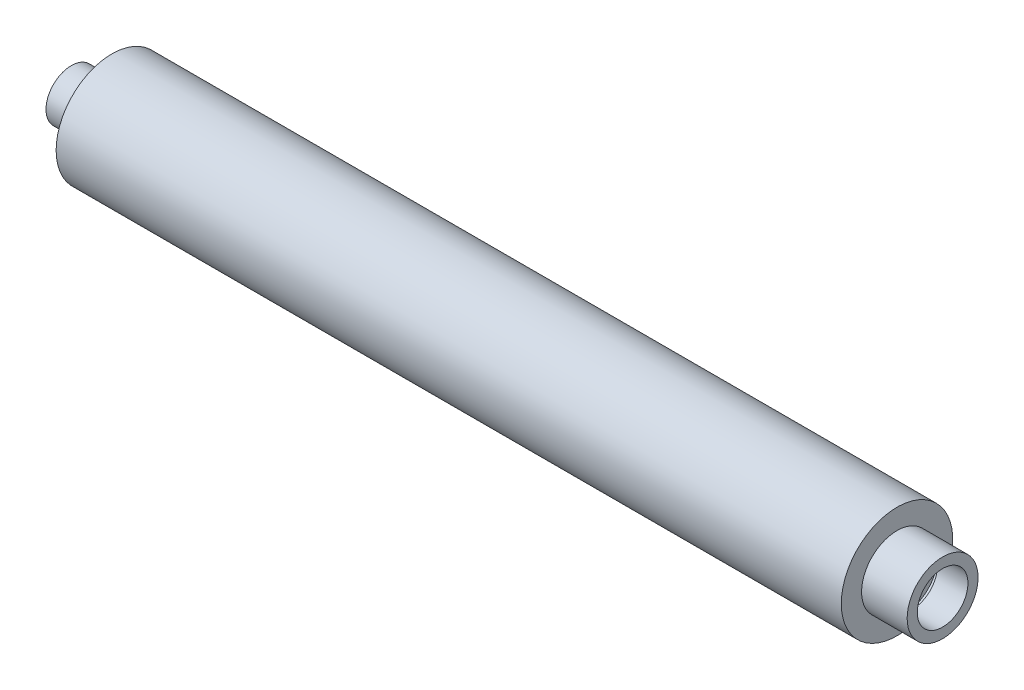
ISO-10303-21;
HEADER;
FILE_DESCRIPTION(('STEP AP214'),'2;1');
FILE_NAME('part.step','',(''),(''),'','','');
FILE_SCHEMA(('AUTOMOTIVE_DESIGN { 1 0 10303 214 1 1 1 1 }'));
ENDSEC;
DATA;
#1=APPLICATION_CONTEXT('core data for automotive mechanical design processes');
#2=APPLICATION_PROTOCOL_DEFINITION('international standard','automotive_design',2000,#1);
#3=PRODUCT_CONTEXT('',#1,'mechanical');
#4=PRODUCT('Part','Part','',(#3));
#5=PRODUCT_RELATED_PRODUCT_CATEGORY('part','',(#4));
#6=PRODUCT_DEFINITION_FORMATION('','',#4);
#7=PRODUCT_DEFINITION_CONTEXT('part definition',#1,'design');
#8=PRODUCT_DEFINITION('design','',#6,#7);
#9=PRODUCT_DEFINITION_SHAPE('','',#8);
#10=(LENGTH_UNIT() NAMED_UNIT(*) SI_UNIT(.MILLI.,.METRE.));
#11=(NAMED_UNIT(*) PLANE_ANGLE_UNIT() SI_UNIT($,.RADIAN.));
#12=(NAMED_UNIT(*) SI_UNIT($,.STERADIAN.) SOLID_ANGLE_UNIT());
#13=UNCERTAINTY_MEASURE_WITH_UNIT(LENGTH_MEASURE(1.E-05),#10,'distance_accuracy_value','');
#14=(GEOMETRIC_REPRESENTATION_CONTEXT(3) GLOBAL_UNCERTAINTY_ASSIGNED_CONTEXT((#13)) GLOBAL_UNIT_ASSIGNED_CONTEXT((#10,
#11,#12)) REPRESENTATION_CONTEXT('',''));
#15=CARTESIAN_POINT('',(0.,0.,0.));
#16=DIRECTION('',(0.,0.,1.));
#17=DIRECTION('',(1.,0.,0.));
#18=AXIS2_PLACEMENT_3D('',#15,#16,#17);
#19=CARTESIAN_POINT('',(-38.,0.,0.));
#20=DIRECTION('',(1.,0.,0.));
#21=DIRECTION('',(0.,0.,-1.));
#22=AXIS2_PLACEMENT_3D('',#19,#20,#21);
#23=PLANE('',#22);
#24=CARTESIAN_POINT('',(-38.,0.,0.));
#25=DIRECTION('',(-1.,0.,0.));
#26=DIRECTION('',(0.,0.,1.));
#27=AXIS2_PLACEMENT_3D('',#24,#25,#26);
#28=CIRCLE('',#27,5.);
#29=CARTESIAN_POINT('',(-38.,0.,5.));
#30=VERTEX_POINT('',#29);
#31=EDGE_CURVE('E10',#30,#30,#28,.T.);
#32=ORIENTED_EDGE('',*,*,#31,.T.);
#33=EDGE_LOOP('',(#32));
#34=FACE_BOUND('',#33,.T.);
#35=ADVANCED_FACE('F28',(#34),#23,.F.);
#36=CARTESIAN_POINT('',(-50.,0.,0.));
#37=DIRECTION('',(-1.,0.,0.));
#38=DIRECTION('',(0.,0.,1.));
#39=AXIS2_PLACEMENT_3D('',#36,#37,#38);
#40=CYLINDRICAL_SURFACE('',#39,5.);
#41=ORIENTED_EDGE('',*,*,#31,.F.);
#42=EDGE_LOOP('',(#41));
#43=FACE_BOUND('',#42,.T.);
#44=CARTESIAN_POINT('',(-30.,0.,0.));
#45=DIRECTION('',(-1.,0.,0.));
#46=DIRECTION('',(0.,0.,1.));
#47=AXIS2_PLACEMENT_3D('',#44,#45,#46);
#48=CIRCLE('',#47,5.);
#49=CARTESIAN_POINT('',(-30.,0.,5.));
#50=VERTEX_POINT('',#49);
#51=EDGE_CURVE('E34',#50,#50,#48,.T.);
#52=ORIENTED_EDGE('',*,*,#51,.T.);
#53=EDGE_LOOP('',(#52));
#54=FACE_BOUND('',#53,.T.);
#55=ADVANCED_FACE('F90',(#43,#54),#40,.T.);
#56=CARTESIAN_POINT('',(-30.,5.,0.));
#57=DIRECTION('',(1.,0.,0.));
#58=DIRECTION('',(0.,0.,-1.));
#59=AXIS2_PLACEMENT_3D('',#56,#57,#58);
#60=PLANE('',#59);
#61=ORIENTED_EDGE('',*,*,#51,.F.);
#62=EDGE_LOOP('',(#61));
#63=FACE_BOUND('',#62,.T.);
#64=CARTESIAN_POINT('',(-30.,0.,0.));
#65=DIRECTION('',(-1.,0.,0.));
#66=DIRECTION('',(0.,0.,1.));
#67=AXIS2_PLACEMENT_3D('',#64,#65,#66);
#68=CIRCLE('',#67,11.);
#69=CARTESIAN_POINT('',(-30.,0.,11.));
#70=VERTEX_POINT('',#69);
#71=EDGE_CURVE('E38',#70,#70,#68,.T.);
#72=ORIENTED_EDGE('',*,*,#71,.T.);
#73=EDGE_LOOP('',(#72));
#74=FACE_BOUND('',#73,.T.);
#75=ADVANCED_FACE('F94',(#63,#74),#60,.F.);
#76=CARTESIAN_POINT('',(-50.,0.,0.));
#77=DIRECTION('',(-1.,0.,0.));
#78=DIRECTION('',(0.,0.,1.));
#79=AXIS2_PLACEMENT_3D('',#76,#77,#78);
#80=CYLINDRICAL_SURFACE('',#79,11.);
#81=ORIENTED_EDGE('',*,*,#71,.F.);
#82=EDGE_LOOP('',(#81));
#83=FACE_BOUND('',#82,.T.);
#84=CARTESIAN_POINT('',(125.,0.,0.));
#85=DIRECTION('',(-1.,0.,0.));
#86=DIRECTION('',(0.,0.,1.));
#87=AXIS2_PLACEMENT_3D('',#84,#85,#86);
#88=CIRCLE('',#87,11.);
#89=CARTESIAN_POINT('',(125.,0.,11.));
#90=VERTEX_POINT('',#89);
#91=EDGE_CURVE('E42',#90,#90,#88,.T.);
#92=ORIENTED_EDGE('',*,*,#91,.T.);
#93=EDGE_LOOP('',(#92));
#94=FACE_BOUND('',#93,.T.);
#95=ADVANCED_FACE('F99',(#83,#94),#80,.T.);
#96=CARTESIAN_POINT('',(125.,11.,0.));
#97=DIRECTION('',(-1.,0.,0.));
#98=DIRECTION('',(0.,0.,1.));
#99=AXIS2_PLACEMENT_3D('',#96,#97,#98);
#100=PLANE('',#99);
#101=ORIENTED_EDGE('',*,*,#91,.F.);
#102=EDGE_LOOP('',(#101));
#103=FACE_BOUND('',#102,.T.);
#104=CARTESIAN_POINT('',(125.,0.,0.));
#105=DIRECTION('',(-1.,0.,0.));
#106=DIRECTION('',(0.,0.,1.));
#107=AXIS2_PLACEMENT_3D('',#104,#105,#106);
#108=CIRCLE('',#107,7.00000000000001);
#109=CARTESIAN_POINT('',(125.,0.,7.00000000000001));
#110=VERTEX_POINT('',#109);
#111=EDGE_CURVE('E47',#110,#110,#108,.T.);
#112=ORIENTED_EDGE('',*,*,#111,.T.);
#113=EDGE_LOOP('',(#112));
#114=FACE_BOUND('',#113,.T.);
#115=ADVANCED_FACE('F105',(#103,#114),#100,.F.);
#116=CARTESIAN_POINT('',(-50.,0.,0.));
#117=DIRECTION('',(-1.,0.,0.));
#118=DIRECTION('',(0.,0.,1.));
#119=AXIS2_PLACEMENT_3D('',#116,#117,#118);
#120=CYLINDRICAL_SURFACE('',#119,7.00000000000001);
#121=ORIENTED_EDGE('',*,*,#111,.F.);
#122=EDGE_LOOP('',(#121));
#123=FACE_BOUND('',#122,.T.);
#124=CARTESIAN_POINT('',(134.,0.,0.));
#125=DIRECTION('',(-1.,0.,0.));
#126=DIRECTION('',(0.,0.,1.));
#127=AXIS2_PLACEMENT_3D('',#124,#125,#126);
#128=CIRCLE('',#127,7.00000000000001);
#129=CARTESIAN_POINT('',(134.,0.,7.00000000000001));
#130=VERTEX_POINT('',#129);
#131=EDGE_CURVE('E50',#130,#130,#128,.T.);
#132=ORIENTED_EDGE('',*,*,#131,.T.);
#133=EDGE_LOOP('',(#132));
#134=FACE_BOUND('',#133,.T.);
#135=ADVANCED_FACE('F109',(#123,#134),#120,.T.);
#136=CARTESIAN_POINT('',(134.,7.00000000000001,0.));
#137=DIRECTION('',(-1.,0.,0.));
#138=DIRECTION('',(0.,0.,1.));
#139=AXIS2_PLACEMENT_3D('',#136,#137,#138);
#140=PLANE('',#139);
#141=ORIENTED_EDGE('',*,*,#131,.F.);
#142=EDGE_LOOP('',(#141));
#143=FACE_BOUND('',#142,.T.);
#144=CARTESIAN_POINT('',(134.,0.,0.));
#145=DIRECTION('',(-1.,0.,0.));
#146=DIRECTION('',(0.,0.,1.));
#147=AXIS2_PLACEMENT_3D('',#144,#145,#146);
#148=CIRCLE('',#147,5.);
#149=CARTESIAN_POINT('',(134.,0.,5.));
#150=VERTEX_POINT('',#149);
#151=EDGE_CURVE('E53',#150,#150,#148,.T.);
#152=ORIENTED_EDGE('',*,*,#151,.T.);
#153=EDGE_LOOP('',(#152));
#154=FACE_BOUND('',#153,.T.);
#155=ADVANCED_FACE('F113',(#143,#154),#140,.F.);
#156=CARTESIAN_POINT('',(-50.,0.,0.));
#157=DIRECTION('',(-1.,0.,0.));
#158=DIRECTION('',(0.,0.,1.));
#159=AXIS2_PLACEMENT_3D('',#156,#157,#158);
#160=CYLINDRICAL_SURFACE('',#159,5.);
#161=ORIENTED_EDGE('',*,*,#151,.F.);
#162=EDGE_LOOP('',(#161));
#163=FACE_BOUND('',#162,.T.);
#164=CARTESIAN_POINT('',(128.,0.,0.));
#165=DIRECTION('',(-1.,0.,0.));
#166=DIRECTION('',(0.,0.,1.));
#167=AXIS2_PLACEMENT_3D('',#164,#165,#166);
#168=CIRCLE('',#167,5.);
#169=CARTESIAN_POINT('',(128.,0.,5.));
#170=VERTEX_POINT('',#169);
#171=EDGE_CURVE('E56',#170,#170,#168,.T.);
#172=ORIENTED_EDGE('',*,*,#171,.T.);
#173=EDGE_LOOP('',(#172));
#174=FACE_BOUND('',#173,.T.);
#175=ADVANCED_FACE('F117',(#163,#174),#160,.F.);
#176=CARTESIAN_POINT('',(128.,5.,0.));
#177=DIRECTION('',(1.,0.,0.));
#178=DIRECTION('',(0.,0.,-1.));
#179=AXIS2_PLACEMENT_3D('',#176,#177,#178);
#180=PLANE('',#179);
#181=ORIENTED_EDGE('',*,*,#171,.F.);
#182=EDGE_LOOP('',(#181));
#183=FACE_BOUND('',#182,.T.);
#184=CARTESIAN_POINT('',(128.,0.,0.));
#185=DIRECTION('',(-1.,0.,0.));
#186=DIRECTION('',(0.,0.,1.));
#187=AXIS2_PLACEMENT_3D('',#184,#185,#186);
#188=CIRCLE('',#187,6.5);
#189=CARTESIAN_POINT('',(128.,0.,6.5));
#190=VERTEX_POINT('',#189);
#191=EDGE_CURVE('E59',#190,#190,#188,.T.);
#192=ORIENTED_EDGE('',*,*,#191,.T.);
#193=EDGE_LOOP('',(#192));
#194=FACE_BOUND('',#193,.T.);
#195=ADVANCED_FACE('F121',(#183,#194),#180,.F.);
#196=CARTESIAN_POINT('',(-50.,0.,0.));
#197=DIRECTION('',(-1.,0.,0.));
#198=DIRECTION('',(0.,0.,1.));
#199=AXIS2_PLACEMENT_3D('',#196,#197,#198);
#200=CYLINDRICAL_SURFACE('',#199,6.5);
#201=ORIENTED_EDGE('',*,*,#191,.F.);
#202=EDGE_LOOP('',(#201));
#203=FACE_BOUND('',#202,.T.);
#204=CARTESIAN_POINT('',(126.5,0.,0.));
#205=DIRECTION('',(-1.,0.,0.));
#206=DIRECTION('',(0.,0.,1.));
#207=AXIS2_PLACEMENT_3D('',#204,#205,#206);
#208=CIRCLE('',#207,6.5);
#209=CARTESIAN_POINT('',(126.5,0.,6.5));
#210=VERTEX_POINT('',#209);
#211=EDGE_CURVE('E62',#210,#210,#208,.T.);
#212=ORIENTED_EDGE('',*,*,#211,.T.);
#213=EDGE_LOOP('',(#212));
#214=FACE_BOUND('',#213,.T.);
#215=ADVANCED_FACE('F125',(#203,#214),#200,.F.);
#216=CARTESIAN_POINT('',(126.5,6.5,0.));
#217=DIRECTION('',(-1.,0.,0.));
#218=DIRECTION('',(0.,0.,1.));
#219=AXIS2_PLACEMENT_3D('',#216,#217,#218);
#220=PLANE('',#219);
#221=ORIENTED_EDGE('',*,*,#211,.F.);
#222=EDGE_LOOP('',(#221));
#223=FACE_BOUND('',#222,.T.);
#224=CARTESIAN_POINT('',(126.5,0.,0.));
#225=DIRECTION('',(-1.,0.,0.));
#226=DIRECTION('',(0.,0.,1.));
#227=AXIS2_PLACEMENT_3D('',#224,#225,#226);
#228=CIRCLE('',#227,5.);
#229=CARTESIAN_POINT('',(126.5,0.,5.));
#230=VERTEX_POINT('',#229);
#231=EDGE_CURVE('E65',#230,#230,#228,.T.);
#232=ORIENTED_EDGE('',*,*,#231,.T.);
#233=EDGE_LOOP('',(#232));
#234=FACE_BOUND('',#233,.T.);
#235=ADVANCED_FACE('F129',(#223,#234),#220,.F.);
#236=CARTESIAN_POINT('',(-50.,0.,0.));
#237=DIRECTION('',(-1.,0.,0.));
#238=DIRECTION('',(0.,0.,1.));
#239=AXIS2_PLACEMENT_3D('',#236,#237,#238);
#240=CYLINDRICAL_SURFACE('',#239,5.);
#241=ORIENTED_EDGE('',*,*,#231,.F.);
#242=EDGE_LOOP('',(#241));
#243=FACE_BOUND('',#242,.T.);
#244=CARTESIAN_POINT('',(124.,0.,0.));
#245=DIRECTION('',(-1.,0.,0.));
#246=DIRECTION('',(0.,0.,1.));
#247=AXIS2_PLACEMENT_3D('',#244,#245,#246);
#248=CIRCLE('',#247,5.);
#249=CARTESIAN_POINT('',(124.,0.,5.));
#250=VERTEX_POINT('',#249);
#251=EDGE_CURVE('E68',#250,#250,#248,.T.);
#252=ORIENTED_EDGE('',*,*,#251,.T.);
#253=EDGE_LOOP('',(#252));
#254=FACE_BOUND('',#253,.T.);
#255=ADVANCED_FACE('F133',(#243,#254),#240,.F.);
#256=CARTESIAN_POINT('',(124.,5.,0.));
#257=DIRECTION('',(1.,0.,0.));
#258=DIRECTION('',(0.,0.,-1.));
#259=AXIS2_PLACEMENT_3D('',#256,#257,#258);
#260=PLANE('',#259);
#261=ORIENTED_EDGE('',*,*,#251,.F.);
#262=EDGE_LOOP('',(#261));
#263=FACE_BOUND('',#262,.T.);
#264=CARTESIAN_POINT('',(124.,0.,0.));
#265=DIRECTION('',(-1.,0.,0.));
#266=DIRECTION('',(0.,0.,1.));
#267=AXIS2_PLACEMENT_3D('',#264,#265,#266);
#268=CIRCLE('',#267,10.);
#269=CARTESIAN_POINT('',(124.,0.,10.));
#270=VERTEX_POINT('',#269);
#271=EDGE_CURVE('E71',#270,#270,#268,.T.);
#272=ORIENTED_EDGE('',*,*,#271,.T.);
#273=EDGE_LOOP('',(#272));
#274=FACE_BOUND('',#273,.T.);
#275=ADVANCED_FACE('F86',(#263,#274),#260,.F.);
#276=CARTESIAN_POINT('',(-50.,0.,0.));
#277=DIRECTION('',(-1.,0.,0.));
#278=DIRECTION('',(0.,0.,1.));
#279=AXIS2_PLACEMENT_3D('',#276,#277,#278);
#280=CYLINDRICAL_SURFACE('',#279,10.);
#281=ORIENTED_EDGE('',*,*,#271,.F.);
#282=EDGE_LOOP('',(#281));
#283=FACE_BOUND('',#282,.T.);
#284=CARTESIAN_POINT('',(-29.,0.,0.));
#285=DIRECTION('',(-1.,0.,0.));
#286=DIRECTION('',(0.,0.,1.));
#287=AXIS2_PLACEMENT_3D('',#284,#285,#286);
#288=CIRCLE('',#287,10.);
#289=CARTESIAN_POINT('',(-29.,0.,10.));
#290=VERTEX_POINT('',#289);
#291=EDGE_CURVE('E74',#290,#290,#288,.T.);
#292=ORIENTED_EDGE('',*,*,#291,.T.);
#293=EDGE_LOOP('',(#292));
#294=FACE_BOUND('',#293,.T.);
#295=ADVANCED_FACE('F78',(#283,#294),#280,.F.);
#296=CARTESIAN_POINT('',(-29.,9.99999999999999,0.));
#297=DIRECTION('',(-1.,0.,0.));
#298=DIRECTION('',(0.,0.,1.));
#299=AXIS2_PLACEMENT_3D('',#296,#297,#298);
#300=PLANE('',#299);
#301=ORIENTED_EDGE('',*,*,#291,.F.);
#302=EDGE_LOOP('',(#301));
#303=FACE_BOUND('',#302,.T.);
#304=ADVANCED_FACE('F80',(#303),#300,.F.);
#305=CLOSED_SHELL('',(#35,#55,#75,#95,#115,#135,#155,#175,#195,#215,#235,#255,#275,#295,#304));
#306=MANIFOLD_SOLID_BREP('B2',#305);
#307=ADVANCED_BREP_SHAPE_REPRESENTATION('',(#18,#306),#14);
#308=SHAPE_DEFINITION_REPRESENTATION(#9,#307);
ENDSEC;
END-ISO-10303-21;
